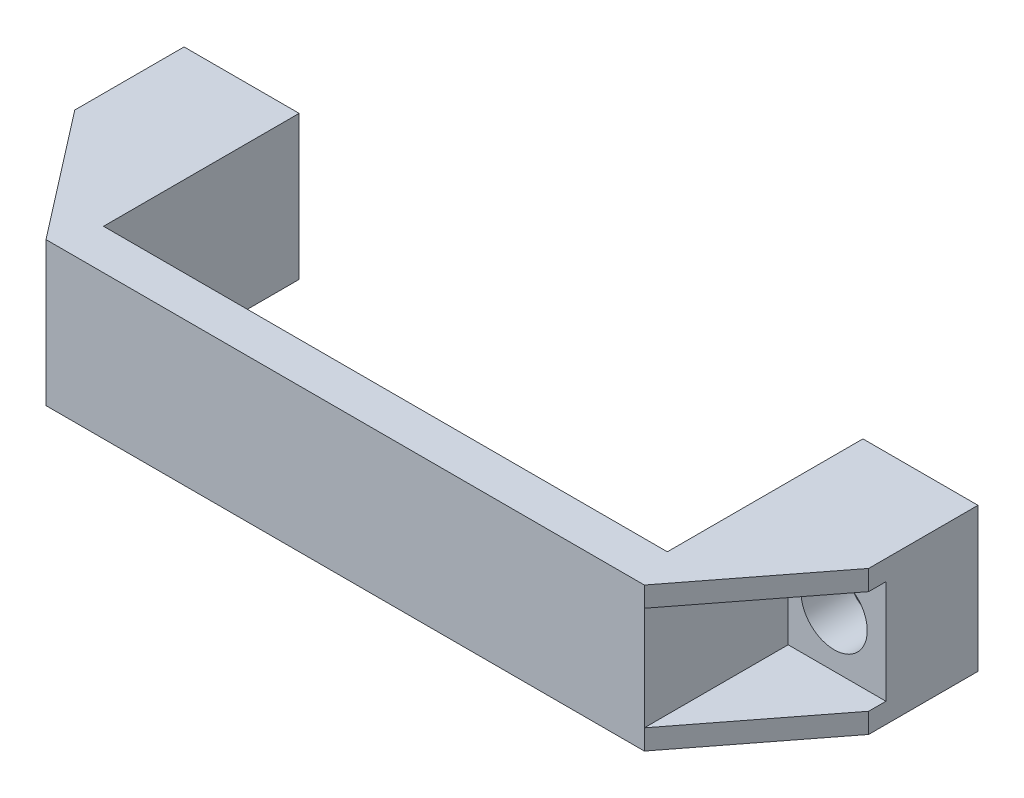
from build123d import *

# Parameters (mm, degrees)
SKETCH_1_W          = 138
SKETCH_1_H          = 25
EXTRUDE_1_DEPTH     = 20.5
SKETCH_2_W          = 98
SKETCH_2_H          = 34
CUT_EXTRUDE_1_DEPTH = 77.198753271
CUT_EXTRUDE_2_DEPTH = 77.198753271
SKETCH_4_R          = 3.25
CUT_EXTRUDE_3_DEPTH = 82.229612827
SKETCH_5_W          = 17
SKETCH_5_H          = 18
CUT_EXTRUDE_4_DEPTH = 25
SKETCH_6_R          = 5.75
CUT_EXTRUDE_5_DEPTH = 8


with BuildPart() as part:
    # Sketch 1 → Extrude 1 (new, symmetric)
    with BuildSketch(Plane.XY):
        Rectangle(SKETCH_1_W, SKETCH_1_H)
    extrude(amount=EXTRUDE_1_DEPTH, both=True)

    # Sketch 2 → Cut-Extrude 1 (cut, through all)
    with BuildSketch(Plane.XZ.offset(12.5)):
        with Locations((0, -3.5)):
            Rectangle(SKETCH_2_W, SKETCH_2_H)
    extrude(amount=-CUT_EXTRUDE_1_DEPTH, mode=Mode.SUBTRACT)

    # Sketch 3 → Cut-Extrude 2 (cut, through all)
    with BuildSketch(Plane.XZ.offset(12.5)):
        Polygon((-52, 20.5), (-69, 20.5), (-69, -1.5), align=None)
        Polygon((69, -1.5), (52, 20.5), (69, 20.5), align=None)
    extrude(amount=-CUT_EXTRUDE_2_DEPTH, mode=Mode.SUBTRACT)

    # Sketch 4 → Cut-Extrude 3 (cut, through all)
    with BuildSketch(Plane(origin=(0, 0, -20.5), x_dir=(-1, 0, 0), z_dir=(0, 0, -1))):
        with Locations((-60, 0)):
            Circle(SKETCH_4_R)
        with Locations((60, 0)):
            Circle(SKETCH_4_R)
    extrude(amount=-CUT_EXTRUDE_3_DEPTH, mode=Mode.SUBTRACT)

    # Sketch 5 → Cut-Extrude 4 (cut)
    with BuildSketch(Plane.XY.offset(20.5)):
        with Locations((-60.5, 0)):
            Rectangle(SKETCH_5_W, SKETCH_5_H)
    cut_extrude_4 = extrude(amount=-CUT_EXTRUDE_4_DEPTH, mode=Mode.SUBTRACT)

    # Mirror 1: Cut-Extrude 4 across plane
    add(cut_extrude_4.mirror(Plane(origin=(0, 0, 0), x_dir=(0, 0, 1), z_dir=(1, 0, 0))), mode=Mode.SUBTRACT)

    # Sketch 6 → Cut-Extrude 5 (cut)
    with BuildSketch(Plane.XY.offset(-4.5)):
        with Locations((-60, 0)):
            Circle(SKETCH_6_R)
        with Locations((60, 0)):
            Circle(SKETCH_6_R)
    extrude(amount=-CUT_EXTRUDE_5_DEPTH, mode=Mode.SUBTRACT)


solid = part.part
